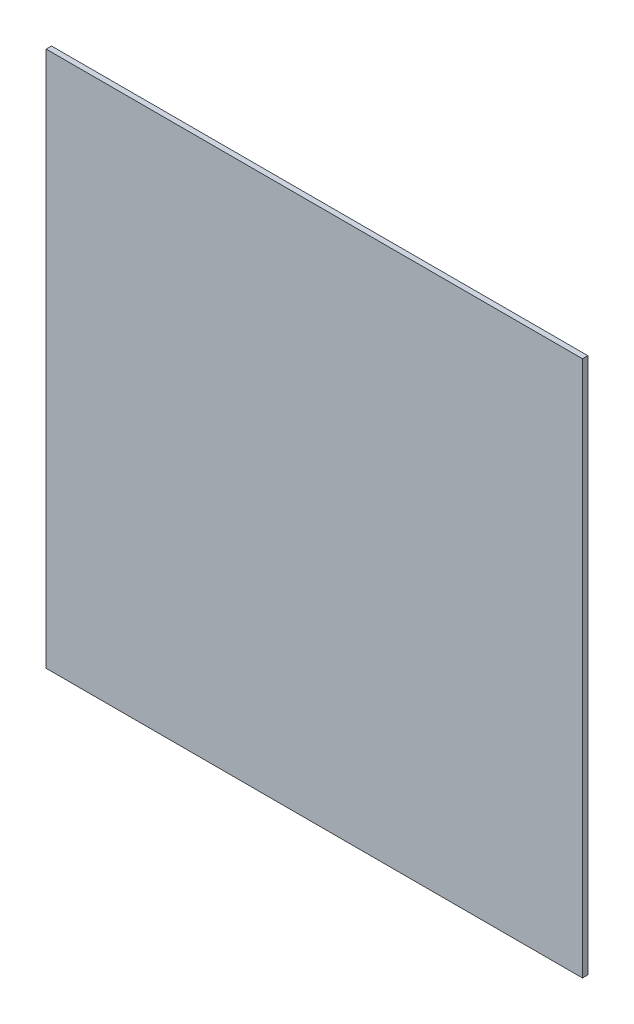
from build123d import *

# Parameters (mm, degrees)
ESQUISSE1_W          = 10000
ESQUISSE1_H          = 10000
BASE_EXTRUSION_DEPTH = 100


with BuildPart() as part:
    # Esquisse1 → Base-Extrusion (new body)
    with BuildSketch(Plane.XY):
        with Locations((4648.652110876, 0)):
            Rectangle(ESQUISSE1_W, ESQUISSE1_H)
    extrude(amount=BASE_EXTRUSION_DEPTH)


solid = part.part
